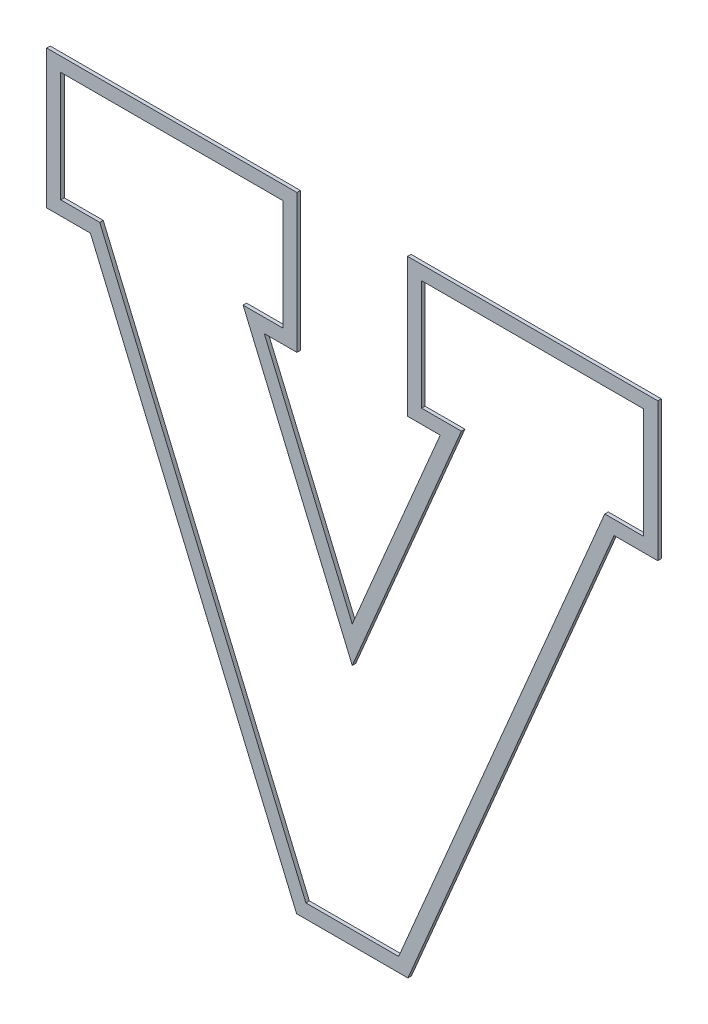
ISO-10303-21;
HEADER;
FILE_DESCRIPTION(('STEP AP214'),'2;1');
FILE_NAME('part.step','',(''),(''),'','','');
FILE_SCHEMA(('AUTOMOTIVE_DESIGN { 1 0 10303 214 1 1 1 1 }'));
ENDSEC;
DATA;
#1=APPLICATION_CONTEXT('core data for automotive mechanical design processes');
#2=APPLICATION_PROTOCOL_DEFINITION('international standard','automotive_design',2000,#1);
#3=PRODUCT_CONTEXT('',#1,'mechanical');
#4=PRODUCT('Part','Part','',(#3));
#5=PRODUCT_RELATED_PRODUCT_CATEGORY('part','',(#4));
#6=PRODUCT_DEFINITION_FORMATION('','',#4);
#7=PRODUCT_DEFINITION_CONTEXT('part definition',#1,'design');
#8=PRODUCT_DEFINITION('design','',#6,#7);
#9=PRODUCT_DEFINITION_SHAPE('','',#8);
#10=(LENGTH_UNIT() NAMED_UNIT(*) SI_UNIT(.MILLI.,.METRE.));
#11=(NAMED_UNIT(*) PLANE_ANGLE_UNIT() SI_UNIT($,.RADIAN.));
#12=(NAMED_UNIT(*) SI_UNIT($,.STERADIAN.) SOLID_ANGLE_UNIT());
#13=UNCERTAINTY_MEASURE_WITH_UNIT(LENGTH_MEASURE(1.E-05),#10,'distance_accuracy_value','');
#14=(GEOMETRIC_REPRESENTATION_CONTEXT(3) GLOBAL_UNCERTAINTY_ASSIGNED_CONTEXT((#13)) GLOBAL_UNIT_ASSIGNED_CONTEXT((#10,
#11,#12)) REPRESENTATION_CONTEXT('',''));
#15=CARTESIAN_POINT('',(0.,0.,0.));
#16=DIRECTION('',(0.,0.,1.));
#17=DIRECTION('',(1.,0.,0.));
#18=AXIS2_PLACEMENT_3D('',#15,#16,#17);
#19=CARTESIAN_POINT('',(0.,0.,3.175));
#20=DIRECTION('',(0.,0.,1.));
#21=DIRECTION('',(1.,0.,0.));
#22=AXIS2_PLACEMENT_3D('',#19,#20,#21);
#23=PLANE('',#22);
#24=DIRECTION('',(0.,-1.,0.));
#25=VECTOR('',#24,1.);
#26=CARTESIAN_POINT('',(326.575403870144,565.454374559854,3.175));
#27=LINE('',#26,#25);
#28=CARTESIAN_POINT('',(326.575403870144,565.454374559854,3.175));
#29=VERTEX_POINT('',#28);
#30=CARTESIAN_POINT('',(326.575403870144,440.106030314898,3.175));
#31=VERTEX_POINT('',#30);
#32=EDGE_CURVE('E344',#29,#31,#27,.T.);
#33=ORIENTED_EDGE('',*,*,#32,.T.);
#34=DIRECTION('',(1.,0.,0.));
#35=VECTOR('',#34,1.);
#36=CARTESIAN_POINT('',(326.575403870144,440.106030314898,3.175));
#37=LINE('',#36,#35);
#38=CARTESIAN_POINT('',(356.125130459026,440.106030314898,3.175));
#39=VERTEX_POINT('',#38);
#40=EDGE_CURVE('E347',#31,#39,#37,.T.);
#41=ORIENTED_EDGE('',*,*,#40,.T.);
#42=DIRECTION('',(-0.39031398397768,-0.920681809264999,0.));
#43=VECTOR('',#42,1.);
#44=CARTESIAN_POINT('',(356.125130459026,440.106030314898,3.175));
#45=LINE('',#44,#43);
#46=CARTESIAN_POINT('',(276.517141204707,252.324832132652,3.175));
#47=VERTEX_POINT('',#46);
#48=EDGE_CURVE('E350',#39,#47,#45,.T.);
#49=ORIENTED_EDGE('',*,*,#48,.T.);
#50=DIRECTION('',(-0.39031398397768,0.920681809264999,0.));
#51=VECTOR('',#50,1.);
#52=CARTESIAN_POINT('',(276.517141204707,252.324832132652,3.175));
#53=LINE('',#52,#51);
#54=CARTESIAN_POINT('',(196.909151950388,440.106030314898,3.175));
#55=VERTEX_POINT('',#54);
#56=EDGE_CURVE('E352',#47,#55,#53,.T.);
#57=ORIENTED_EDGE('',*,*,#56,.T.);
#58=DIRECTION('',(1.,0.,0.));
#59=VECTOR('',#58,1.);
#60=CARTESIAN_POINT('',(196.909151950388,440.106030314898,3.175));
#61=LINE('',#60,#59);
#62=CARTESIAN_POINT('',(226.45887853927,440.106030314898,3.175));
#63=VERTEX_POINT('',#62);
#64=EDGE_CURVE('E354',#55,#63,#61,.T.);
#65=ORIENTED_EDGE('',*,*,#64,.T.);
#66=DIRECTION('',(0.,1.,0.));
#67=VECTOR('',#66,1.);
#68=CARTESIAN_POINT('',(226.45887853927,440.106030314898,3.175));
#69=LINE('',#68,#67);
#70=CARTESIAN_POINT('',(226.45887853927,565.454374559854,3.175));
#71=VERTEX_POINT('',#70);
#72=EDGE_CURVE('E356',#63,#71,#69,.T.);
#73=ORIENTED_EDGE('',*,*,#72,.T.);
#74=DIRECTION('',(-1.,0.,0.));
#75=VECTOR('',#74,1.);
#76=CARTESIAN_POINT('',(226.45887853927,565.454374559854,3.175));
#77=LINE('',#76,#75);
#78=CARTESIAN_POINT('',(0.,565.454374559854,3.175));
#79=VERTEX_POINT('',#78);
#80=EDGE_CURVE('E358',#71,#79,#77,.T.);
#81=ORIENTED_EDGE('',*,*,#80,.T.);
#82=DIRECTION('',(0.,-1.,0.));
#83=VECTOR('',#82,1.);
#84=CARTESIAN_POINT('',(0.,565.454374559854,3.175));
#85=LINE('',#84,#83);
#86=CARTESIAN_POINT('',(0.,440.106030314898,3.175));
#87=VERTEX_POINT('',#86);
#88=EDGE_CURVE('E360',#79,#87,#85,.T.);
#89=ORIENTED_EDGE('',*,*,#88,.T.);
#90=DIRECTION('',(1.,0.,0.));
#91=VECTOR('',#90,1.);
#92=CARTESIAN_POINT('',(0.,440.106030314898,3.175));
#93=LINE('',#92,#91);
#94=CARTESIAN_POINT('',(39.5591606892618,440.106030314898,3.175));
#95=VERTEX_POINT('',#94);
#96=EDGE_CURVE('E362',#87,#95,#93,.T.);
#97=ORIENTED_EDGE('',*,*,#96,.T.);
#98=DIRECTION('',(0.39031398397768,-0.920681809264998,0.));
#99=VECTOR('',#98,1.);
#100=CARTESIAN_POINT('',(39.5591606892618,440.106030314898,3.175));
#101=LINE('',#100,#99);
#102=CARTESIAN_POINT('',(226.137777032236,0.,3.175));
#103=VERTEX_POINT('',#102);
#104=EDGE_CURVE('E364',#95,#103,#101,.T.);
#105=ORIENTED_EDGE('',*,*,#104,.T.);
#106=DIRECTION('',(1.,0.,0.));
#107=VECTOR('',#106,1.);
#108=CARTESIAN_POINT('',(226.137777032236,0.,3.175));
#109=LINE('',#108,#107);
#110=CARTESIAN_POINT('',(326.896505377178,0.,3.175));
#111=VERTEX_POINT('',#110);
#112=EDGE_CURVE('E366',#103,#111,#109,.T.);
#113=ORIENTED_EDGE('',*,*,#112,.T.);
#114=DIRECTION('',(0.39031398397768,0.920681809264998,0.));
#115=VECTOR('',#114,1.);
#116=CARTESIAN_POINT('',(326.896505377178,0.,3.175));
#117=LINE('',#116,#115);
#118=CARTESIAN_POINT('',(513.475121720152,440.106030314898,3.175));
#119=VERTEX_POINT('',#118);
#120=EDGE_CURVE('E368',#111,#119,#117,.T.);
#121=ORIENTED_EDGE('',*,*,#120,.T.);
#122=DIRECTION('',(1.,0.,0.));
#123=VECTOR('',#122,1.);
#124=CARTESIAN_POINT('',(513.475121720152,440.106030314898,3.175));
#125=LINE('',#124,#123);
#126=CARTESIAN_POINT('',(553.034282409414,440.106030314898,3.175));
#127=VERTEX_POINT('',#126);
#128=EDGE_CURVE('E370',#119,#127,#125,.T.);
#129=ORIENTED_EDGE('',*,*,#128,.T.);
#130=DIRECTION('',(0.,1.,0.));
#131=VECTOR('',#130,1.);
#132=CARTESIAN_POINT('',(553.034282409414,440.106030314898,3.175));
#133=LINE('',#132,#131);
#134=CARTESIAN_POINT('',(553.034282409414,565.454374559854,3.175));
#135=VERTEX_POINT('',#134);
#136=EDGE_CURVE('E372',#127,#135,#133,.T.);
#137=ORIENTED_EDGE('',*,*,#136,.T.);
#138=DIRECTION('',(-1.,0.,0.));
#139=VECTOR('',#138,1.);
#140=CARTESIAN_POINT('',(553.034282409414,565.454374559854,3.175));
#141=LINE('',#140,#139);
#142=EDGE_CURVE('E374',#135,#29,#141,.T.);
#143=ORIENTED_EDGE('',*,*,#142,.T.);
#144=EDGE_LOOP('',(#33,#41,#49,#57,#65,#73,#81,#89,#97,#105,#113,#121,#129,#137,#143));
#145=FACE_BOUND('',#144,.T.);
#146=DIRECTION('',(1.,0.,0.));
#147=VECTOR('',#146,1.);
#148=CARTESIAN_POINT('',(540.334282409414,452.806030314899,3.175));
#149=LINE('',#148,#147);
#150=CARTESIAN_POINT('',(505.065036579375,452.806030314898,3.175));
#151=VERTEX_POINT('',#150);
#152=CARTESIAN_POINT('',(540.334282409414,452.806030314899,3.175));
#153=VERTEX_POINT('',#152);
#154=EDGE_CURVE('E238',#151,#153,#149,.T.);
#155=ORIENTED_EDGE('',*,*,#154,.F.);
#156=DIRECTION('',(0.39031398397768,0.920681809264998,0.));
#157=VECTOR('',#156,1.);
#158=CARTESIAN_POINT('',(505.065036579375,452.806030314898,3.175));
#159=LINE('',#158,#157);
#160=CARTESIAN_POINT('',(318.4864202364,12.6999999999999,3.175));
#161=VERTEX_POINT('',#160);
#162=EDGE_CURVE('E230',#161,#151,#159,.T.);
#163=ORIENTED_EDGE('',*,*,#162,.F.);
#164=DIRECTION('',(1.,0.,0.));
#165=VECTOR('',#164,1.);
#166=CARTESIAN_POINT('',(318.4864202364,12.6999999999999,3.175));
#167=LINE('',#166,#165);
#168=CARTESIAN_POINT('',(234.547862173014,12.7,3.175));
#169=VERTEX_POINT('',#168);
#170=EDGE_CURVE('E277',#169,#161,#167,.T.);
#171=ORIENTED_EDGE('',*,*,#170,.F.);
#172=DIRECTION('',(0.39031398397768,-0.920681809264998,0.));
#173=VECTOR('',#172,1.);
#174=CARTESIAN_POINT('',(234.547862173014,12.7,3.175));
#175=LINE('',#174,#173);
#176=CARTESIAN_POINT('',(47.969245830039,452.806030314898,3.175));
#177=VERTEX_POINT('',#176);
#178=EDGE_CURVE('E275',#177,#169,#175,.T.);
#179=ORIENTED_EDGE('',*,*,#178,.F.);
#180=DIRECTION('',(1.,0.,0.));
#181=VECTOR('',#180,1.);
#182=CARTESIAN_POINT('',(47.969245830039,452.806030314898,3.175));
#183=LINE('',#182,#181);
#184=CARTESIAN_POINT('',(12.7,452.806030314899,3.175));
#185=VERTEX_POINT('',#184);
#186=EDGE_CURVE('E273',#185,#177,#183,.T.);
#187=ORIENTED_EDGE('',*,*,#186,.F.);
#188=DIRECTION('',(0.,-1.,0.));
#189=VECTOR('',#188,1.);
#190=CARTESIAN_POINT('',(12.7,452.806030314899,3.175));
#191=LINE('',#190,#189);
#192=CARTESIAN_POINT('',(12.7,552.754374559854,3.175));
#193=VERTEX_POINT('',#192);
#194=EDGE_CURVE('E271',#193,#185,#191,.T.);
#195=ORIENTED_EDGE('',*,*,#194,.F.);
#196=DIRECTION('',(-1.,0.,0.));
#197=VECTOR('',#196,1.);
#198=CARTESIAN_POINT('',(12.7,552.754374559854,3.175));
#199=LINE('',#198,#197);
#200=CARTESIAN_POINT('',(213.75887853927,552.754374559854,3.175));
#201=VERTEX_POINT('',#200);
#202=EDGE_CURVE('E269',#201,#193,#199,.T.);
#203=ORIENTED_EDGE('',*,*,#202,.F.);
#204=DIRECTION('',(0.,1.,0.));
#205=VECTOR('',#204,1.);
#206=CARTESIAN_POINT('',(213.75887853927,552.754374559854,3.175));
#207=LINE('',#206,#205);
#208=CARTESIAN_POINT('',(213.75887853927,452.806030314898,3.175));
#209=VERTEX_POINT('',#208);
#210=EDGE_CURVE('E267',#209,#201,#207,.T.);
#211=ORIENTED_EDGE('',*,*,#210,.F.);
#212=DIRECTION('',(1.,0.,0.));
#213=VECTOR('',#212,1.);
#214=CARTESIAN_POINT('',(213.75887853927,452.806030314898,3.175));
#215=LINE('',#214,#213);
#216=CARTESIAN_POINT('',(177.730987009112,452.806030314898,3.175));
#217=VERTEX_POINT('',#216);
#218=EDGE_CURVE('E265',#217,#209,#215,.T.);
#219=ORIENTED_EDGE('',*,*,#218,.F.);
#220=DIRECTION('',(-0.39031398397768,0.920681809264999,0.));
#221=VECTOR('',#220,1.);
#222=CARTESIAN_POINT('',(177.730987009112,452.806030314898,3.175));
#223=LINE('',#222,#221);
#224=CARTESIAN_POINT('',(276.517141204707,219.78692541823,3.175));
#225=VERTEX_POINT('',#224);
#226=EDGE_CURVE('E263',#225,#217,#223,.T.);
#227=ORIENTED_EDGE('',*,*,#226,.F.);
#228=DIRECTION('',(-0.39031398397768,-0.920681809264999,0.));
#229=VECTOR('',#228,1.);
#230=CARTESIAN_POINT('',(276.517141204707,219.78692541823,3.175));
#231=LINE('',#230,#229);
#232=CARTESIAN_POINT('',(375.303295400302,452.806030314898,3.175));
#233=VERTEX_POINT('',#232);
#234=EDGE_CURVE('E261',#233,#225,#231,.T.);
#235=ORIENTED_EDGE('',*,*,#234,.F.);
#236=DIRECTION('',(1.,0.,0.));
#237=VECTOR('',#236,1.);
#238=CARTESIAN_POINT('',(375.303295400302,452.806030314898,3.175));
#239=LINE('',#238,#237);
#240=CARTESIAN_POINT('',(339.275403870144,452.806030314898,3.175));
#241=VERTEX_POINT('',#240);
#242=EDGE_CURVE('E259',#241,#233,#239,.T.);
#243=ORIENTED_EDGE('',*,*,#242,.F.);
#244=DIRECTION('',(0.,-1.,0.));
#245=VECTOR('',#244,1.);
#246=CARTESIAN_POINT('',(339.275403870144,452.806030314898,3.175));
#247=LINE('',#246,#245);
#248=CARTESIAN_POINT('',(339.275403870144,552.754374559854,3.175));
#249=VERTEX_POINT('',#248);
#250=EDGE_CURVE('E257',#249,#241,#247,.T.);
#251=ORIENTED_EDGE('',*,*,#250,.F.);
#252=DIRECTION('',(-1.,0.,0.));
#253=VECTOR('',#252,1.);
#254=CARTESIAN_POINT('',(339.275403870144,552.754374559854,3.175));
#255=LINE('',#254,#253);
#256=CARTESIAN_POINT('',(540.334282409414,552.754374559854,3.175));
#257=VERTEX_POINT('',#256);
#258=EDGE_CURVE('E253',#257,#249,#255,.T.);
#259=ORIENTED_EDGE('',*,*,#258,.F.);
#260=DIRECTION('',(0.,1.,0.));
#261=VECTOR('',#260,1.);
#262=CARTESIAN_POINT('',(540.334282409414,552.754374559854,3.175));
#263=LINE('',#262,#261);
#264=EDGE_CURVE('E251',#153,#257,#263,.T.);
#265=ORIENTED_EDGE('',*,*,#264,.F.);
#266=EDGE_LOOP('',(#155,#163,#171,#179,#187,#195,#203,#211,#219,#227,#235,#243,#251,#259,#265));
#267=FACE_BOUND('',#266,.T.);
#268=ADVANCED_FACE('F33',(#145,#267),#23,.T.);
#269=CARTESIAN_POINT('',(0.,0.,0.));
#270=DIRECTION('',(0.,0.,1.));
#271=DIRECTION('',(1.,0.,0.));
#272=AXIS2_PLACEMENT_3D('',#269,#270,#271);
#273=PLANE('',#272);
#274=DIRECTION('',(0.,-1.,0.));
#275=VECTOR('',#274,1.);
#276=CARTESIAN_POINT('',(326.575403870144,565.454374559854,0.));
#277=LINE('',#276,#275);
#278=CARTESIAN_POINT('',(326.575403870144,565.454374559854,0.));
#279=VERTEX_POINT('',#278);
#280=CARTESIAN_POINT('',(326.575403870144,440.106030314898,0.));
#281=VERTEX_POINT('',#280);
#282=EDGE_CURVE('E246',#279,#281,#277,.T.);
#283=ORIENTED_EDGE('',*,*,#282,.F.);
#284=DIRECTION('',(-1.,0.,0.));
#285=VECTOR('',#284,1.);
#286=CARTESIAN_POINT('',(553.034282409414,565.454374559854,0.));
#287=LINE('',#286,#285);
#288=CARTESIAN_POINT('',(553.034282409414,565.454374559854,0.));
#289=VERTEX_POINT('',#288);
#290=EDGE_CURVE('E348',#289,#279,#287,.T.);
#291=ORIENTED_EDGE('',*,*,#290,.F.);
#292=DIRECTION('',(0.,1.,0.));
#293=VECTOR('',#292,1.);
#294=CARTESIAN_POINT('',(553.034282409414,440.106030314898,0.));
#295=LINE('',#294,#293);
#296=CARTESIAN_POINT('',(553.034282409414,440.106030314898,0.));
#297=VERTEX_POINT('',#296);
#298=EDGE_CURVE('E403',#297,#289,#295,.T.);
#299=ORIENTED_EDGE('',*,*,#298,.F.);
#300=DIRECTION('',(1.,0.,0.));
#301=VECTOR('',#300,1.);
#302=CARTESIAN_POINT('',(513.475121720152,440.106030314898,0.));
#303=LINE('',#302,#301);
#304=CARTESIAN_POINT('',(513.475121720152,440.106030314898,0.));
#305=VERTEX_POINT('',#304);
#306=EDGE_CURVE('E401',#305,#297,#303,.T.);
#307=ORIENTED_EDGE('',*,*,#306,.F.);
#308=DIRECTION('',(0.39031398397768,0.920681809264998,0.));
#309=VECTOR('',#308,1.);
#310=CARTESIAN_POINT('',(326.896505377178,0.,0.));
#311=LINE('',#310,#309);
#312=CARTESIAN_POINT('',(326.896505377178,0.,0.));
#313=VERTEX_POINT('',#312);
#314=EDGE_CURVE('E399',#313,#305,#311,.T.);
#315=ORIENTED_EDGE('',*,*,#314,.F.);
#316=DIRECTION('',(1.,0.,0.));
#317=VECTOR('',#316,1.);
#318=CARTESIAN_POINT('',(226.137777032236,0.,0.));
#319=LINE('',#318,#317);
#320=CARTESIAN_POINT('',(226.137777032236,0.,0.));
#321=VERTEX_POINT('',#320);
#322=EDGE_CURVE('E397',#321,#313,#319,.T.);
#323=ORIENTED_EDGE('',*,*,#322,.F.);
#324=DIRECTION('',(0.39031398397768,-0.920681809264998,0.));
#325=VECTOR('',#324,1.);
#326=CARTESIAN_POINT('',(39.5591606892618,440.106030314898,0.));
#327=LINE('',#326,#325);
#328=CARTESIAN_POINT('',(39.5591606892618,440.106030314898,0.));
#329=VERTEX_POINT('',#328);
#330=EDGE_CURVE('E395',#329,#321,#327,.T.);
#331=ORIENTED_EDGE('',*,*,#330,.F.);
#332=DIRECTION('',(1.,0.,0.));
#333=VECTOR('',#332,1.);
#334=CARTESIAN_POINT('',(0.,440.106030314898,0.));
#335=LINE('',#334,#333);
#336=CARTESIAN_POINT('',(0.,440.106030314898,0.));
#337=VERTEX_POINT('',#336);
#338=EDGE_CURVE('E393',#337,#329,#335,.T.);
#339=ORIENTED_EDGE('',*,*,#338,.F.);
#340=DIRECTION('',(0.,-1.,0.));
#341=VECTOR('',#340,1.);
#342=CARTESIAN_POINT('',(0.,565.454374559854,0.));
#343=LINE('',#342,#341);
#344=CARTESIAN_POINT('',(0.,565.454374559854,0.));
#345=VERTEX_POINT('',#344);
#346=EDGE_CURVE('E391',#345,#337,#343,.T.);
#347=ORIENTED_EDGE('',*,*,#346,.F.);
#348=DIRECTION('',(-1.,0.,0.));
#349=VECTOR('',#348,1.);
#350=CARTESIAN_POINT('',(226.45887853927,565.454374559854,0.));
#351=LINE('',#350,#349);
#352=CARTESIAN_POINT('',(226.45887853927,565.454374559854,0.));
#353=VERTEX_POINT('',#352);
#354=EDGE_CURVE('E389',#353,#345,#351,.T.);
#355=ORIENTED_EDGE('',*,*,#354,.F.);
#356=DIRECTION('',(0.,1.,0.));
#357=VECTOR('',#356,1.);
#358=CARTESIAN_POINT('',(226.45887853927,440.106030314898,0.));
#359=LINE('',#358,#357);
#360=CARTESIAN_POINT('',(226.45887853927,440.106030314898,0.));
#361=VERTEX_POINT('',#360);
#362=EDGE_CURVE('E387',#361,#353,#359,.T.);
#363=ORIENTED_EDGE('',*,*,#362,.F.);
#364=DIRECTION('',(1.,0.,0.));
#365=VECTOR('',#364,1.);
#366=CARTESIAN_POINT('',(196.909151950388,440.106030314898,0.));
#367=LINE('',#366,#365);
#368=CARTESIAN_POINT('',(196.909151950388,440.106030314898,0.));
#369=VERTEX_POINT('',#368);
#370=EDGE_CURVE('E385',#369,#361,#367,.T.);
#371=ORIENTED_EDGE('',*,*,#370,.F.);
#372=DIRECTION('',(-0.39031398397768,0.920681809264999,0.));
#373=VECTOR('',#372,1.);
#374=CARTESIAN_POINT('',(276.517141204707,252.324832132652,0.));
#375=LINE('',#374,#373);
#376=CARTESIAN_POINT('',(276.517141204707,252.324832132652,0.));
#377=VERTEX_POINT('',#376);
#378=EDGE_CURVE('E383',#377,#369,#375,.T.);
#379=ORIENTED_EDGE('',*,*,#378,.F.);
#380=DIRECTION('',(-0.39031398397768,-0.920681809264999,0.));
#381=VECTOR('',#380,1.);
#382=CARTESIAN_POINT('',(356.125130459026,440.106030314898,0.));
#383=LINE('',#382,#381);
#384=CARTESIAN_POINT('',(356.125130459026,440.106030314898,0.));
#385=VERTEX_POINT('',#384);
#386=EDGE_CURVE('E381',#385,#377,#383,.T.);
#387=ORIENTED_EDGE('',*,*,#386,.F.);
#388=DIRECTION('',(1.,0.,0.));
#389=VECTOR('',#388,1.);
#390=CARTESIAN_POINT('',(326.575403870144,440.106030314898,0.));
#391=LINE('',#390,#389);
#392=EDGE_CURVE('E379',#281,#385,#391,.T.);
#393=ORIENTED_EDGE('',*,*,#392,.F.);
#394=EDGE_LOOP('',(#283,#291,#299,#307,#315,#323,#331,#339,#347,#355,#363,#371,#379,#387,#393));
#395=FACE_BOUND('',#394,.T.);
#396=DIRECTION('',(0.39031398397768,0.920681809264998,0.));
#397=VECTOR('',#396,1.);
#398=CARTESIAN_POINT('',(505.065036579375,452.806030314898,0.));
#399=LINE('',#398,#397);
#400=CARTESIAN_POINT('',(318.4864202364,12.6999999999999,0.));
#401=VERTEX_POINT('',#400);
#402=CARTESIAN_POINT('',(505.065036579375,452.806030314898,0.));
#403=VERTEX_POINT('',#402);
#404=EDGE_CURVE('E56',#401,#403,#399,.T.);
#405=ORIENTED_EDGE('',*,*,#404,.T.);
#406=DIRECTION('',(1.,0.,0.));
#407=VECTOR('',#406,1.);
#408=CARTESIAN_POINT('',(540.334282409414,452.806030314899,0.));
#409=LINE('',#408,#407);
#410=CARTESIAN_POINT('',(540.334282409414,452.806030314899,0.));
#411=VERTEX_POINT('',#410);
#412=EDGE_CURVE('E245',#403,#411,#409,.T.);
#413=ORIENTED_EDGE('',*,*,#412,.T.);
#414=DIRECTION('',(0.,1.,0.));
#415=VECTOR('',#414,1.);
#416=CARTESIAN_POINT('',(540.334282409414,552.754374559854,0.));
#417=LINE('',#416,#415);
#418=CARTESIAN_POINT('',(540.334282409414,552.754374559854,0.));
#419=VERTEX_POINT('',#418);
#420=EDGE_CURVE('E281',#411,#419,#417,.T.);
#421=ORIENTED_EDGE('',*,*,#420,.T.);
#422=DIRECTION('',(-1.,0.,0.));
#423=VECTOR('',#422,1.);
#424=CARTESIAN_POINT('',(339.275403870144,552.754374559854,0.));
#425=LINE('',#424,#423);
#426=CARTESIAN_POINT('',(339.275403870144,552.754374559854,0.));
#427=VERTEX_POINT('',#426);
#428=EDGE_CURVE('E284',#419,#427,#425,.T.);
#429=ORIENTED_EDGE('',*,*,#428,.T.);
#430=DIRECTION('',(0.,-1.,0.));
#431=VECTOR('',#430,1.);
#432=CARTESIAN_POINT('',(339.275403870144,452.806030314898,0.));
#433=LINE('',#432,#431);
#434=CARTESIAN_POINT('',(339.275403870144,452.806030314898,0.));
#435=VERTEX_POINT('',#434);
#436=EDGE_CURVE('E287',#427,#435,#433,.T.);
#437=ORIENTED_EDGE('',*,*,#436,.T.);
#438=DIRECTION('',(1.,0.,0.));
#439=VECTOR('',#438,1.);
#440=CARTESIAN_POINT('',(375.303295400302,452.806030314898,0.));
#441=LINE('',#440,#439);
#442=CARTESIAN_POINT('',(375.303295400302,452.806030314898,0.));
#443=VERTEX_POINT('',#442);
#444=EDGE_CURVE('E290',#435,#443,#441,.T.);
#445=ORIENTED_EDGE('',*,*,#444,.T.);
#446=DIRECTION('',(-0.39031398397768,-0.920681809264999,0.));
#447=VECTOR('',#446,1.);
#448=CARTESIAN_POINT('',(276.517141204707,219.78692541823,0.));
#449=LINE('',#448,#447);
#450=CARTESIAN_POINT('',(276.517141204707,219.78692541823,0.));
#451=VERTEX_POINT('',#450);
#452=EDGE_CURVE('E293',#443,#451,#449,.T.);
#453=ORIENTED_EDGE('',*,*,#452,.T.);
#454=DIRECTION('',(-0.39031398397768,0.920681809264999,0.));
#455=VECTOR('',#454,1.);
#456=CARTESIAN_POINT('',(177.730987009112,452.806030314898,0.));
#457=LINE('',#456,#455);
#458=CARTESIAN_POINT('',(177.730987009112,452.806030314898,0.));
#459=VERTEX_POINT('',#458);
#460=EDGE_CURVE('E296',#451,#459,#457,.T.);
#461=ORIENTED_EDGE('',*,*,#460,.T.);
#462=DIRECTION('',(1.,0.,0.));
#463=VECTOR('',#462,1.);
#464=CARTESIAN_POINT('',(213.75887853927,452.806030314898,0.));
#465=LINE('',#464,#463);
#466=CARTESIAN_POINT('',(213.75887853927,452.806030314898,0.));
#467=VERTEX_POINT('',#466);
#468=EDGE_CURVE('E299',#459,#467,#465,.T.);
#469=ORIENTED_EDGE('',*,*,#468,.T.);
#470=DIRECTION('',(0.,1.,0.));
#471=VECTOR('',#470,1.);
#472=CARTESIAN_POINT('',(213.75887853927,552.754374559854,0.));
#473=LINE('',#472,#471);
#474=CARTESIAN_POINT('',(213.75887853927,552.754374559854,0.));
#475=VERTEX_POINT('',#474);
#476=EDGE_CURVE('E302',#467,#475,#473,.T.);
#477=ORIENTED_EDGE('',*,*,#476,.T.);
#478=DIRECTION('',(-1.,0.,0.));
#479=VECTOR('',#478,1.);
#480=CARTESIAN_POINT('',(12.7,552.754374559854,0.));
#481=LINE('',#480,#479);
#482=CARTESIAN_POINT('',(12.7,552.754374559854,0.));
#483=VERTEX_POINT('',#482);
#484=EDGE_CURVE('E305',#475,#483,#481,.T.);
#485=ORIENTED_EDGE('',*,*,#484,.T.);
#486=DIRECTION('',(0.,-1.,0.));
#487=VECTOR('',#486,1.);
#488=CARTESIAN_POINT('',(12.7,452.806030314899,0.));
#489=LINE('',#488,#487);
#490=CARTESIAN_POINT('',(12.7,452.806030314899,0.));
#491=VERTEX_POINT('',#490);
#492=EDGE_CURVE('E308',#483,#491,#489,.T.);
#493=ORIENTED_EDGE('',*,*,#492,.T.);
#494=DIRECTION('',(1.,0.,0.));
#495=VECTOR('',#494,1.);
#496=CARTESIAN_POINT('',(47.969245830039,452.806030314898,0.));
#497=LINE('',#496,#495);
#498=CARTESIAN_POINT('',(47.969245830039,452.806030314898,0.));
#499=VERTEX_POINT('',#498);
#500=EDGE_CURVE('E311',#491,#499,#497,.T.);
#501=ORIENTED_EDGE('',*,*,#500,.T.);
#502=DIRECTION('',(0.39031398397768,-0.920681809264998,0.));
#503=VECTOR('',#502,1.);
#504=CARTESIAN_POINT('',(234.547862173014,12.7,0.));
#505=LINE('',#504,#503);
#506=CARTESIAN_POINT('',(234.547862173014,12.7,0.));
#507=VERTEX_POINT('',#506);
#508=EDGE_CURVE('E314',#499,#507,#505,.T.);
#509=ORIENTED_EDGE('',*,*,#508,.T.);
#510=DIRECTION('',(1.,0.,0.));
#511=VECTOR('',#510,1.);
#512=CARTESIAN_POINT('',(318.4864202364,12.6999999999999,0.));
#513=LINE('',#512,#511);
#514=EDGE_CURVE('E239',#507,#401,#513,.T.);
#515=ORIENTED_EDGE('',*,*,#514,.T.);
#516=EDGE_LOOP('',(#405,#413,#421,#429,#437,#445,#453,#461,#469,#477,#485,#493,#501,#509,#515));
#517=FACE_BOUND('',#516,.T.);
#518=ADVANCED_FACE('F454',(#395,#517),#273,.F.);
#519=CARTESIAN_POINT('',(326.575403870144,565.454374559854,3.175));
#520=DIRECTION('',(1.,0.,0.));
#521=DIRECTION('',(0.,0.,-1.));
#522=AXIS2_PLACEMENT_3D('',#519,#520,#521);
#523=PLANE('',#522);
#524=ORIENTED_EDGE('',*,*,#282,.T.);
#525=DIRECTION('',(0.,0.,-1.));
#526=VECTOR('',#525,1.);
#527=CARTESIAN_POINT('',(326.575403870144,440.106030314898,3.175));
#528=LINE('',#527,#526);
#529=EDGE_CURVE('E11',#31,#281,#528,.T.);
#530=ORIENTED_EDGE('',*,*,#529,.F.);
#531=ORIENTED_EDGE('',*,*,#32,.F.);
#532=DIRECTION('',(0.,0.,-1.));
#533=VECTOR('',#532,1.);
#534=CARTESIAN_POINT('',(326.575403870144,565.454374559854,3.175));
#535=LINE('',#534,#533);
#536=EDGE_CURVE('E376',#29,#279,#535,.T.);
#537=ORIENTED_EDGE('',*,*,#536,.T.);
#538=EDGE_LOOP('',(#524,#530,#531,#537));
#539=FACE_BOUND('',#538,.T.);
#540=ADVANCED_FACE('F35',(#539),#523,.F.);
#541=CARTESIAN_POINT('',(326.575403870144,440.106030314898,3.175));
#542=DIRECTION('',(0.,1.,0.));
#543=DIRECTION('',(0.,0.,1.));
#544=AXIS2_PLACEMENT_3D('',#541,#542,#543);
#545=PLANE('',#544);
#546=ORIENTED_EDGE('',*,*,#392,.T.);
#547=DIRECTION('',(0.,0.,-1.));
#548=VECTOR('',#547,1.);
#549=CARTESIAN_POINT('',(356.125130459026,440.106030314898,3.175));
#550=LINE('',#549,#548);
#551=EDGE_CURVE('E41',#39,#385,#550,.T.);
#552=ORIENTED_EDGE('',*,*,#551,.F.);
#553=ORIENTED_EDGE('',*,*,#40,.F.);
#554=ORIENTED_EDGE('',*,*,#529,.T.);
#555=EDGE_LOOP('',(#546,#552,#553,#554));
#556=FACE_BOUND('',#555,.T.);
#557=ADVANCED_FACE('F471',(#556),#545,.F.);
#558=CARTESIAN_POINT('',(356.125130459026,440.106030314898,3.175));
#559=DIRECTION('',(0.920681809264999,-0.39031398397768,0.));
#560=DIRECTION('',(0.39031398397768,0.920681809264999,0.));
#561=AXIS2_PLACEMENT_3D('',#558,#559,#560);
#562=PLANE('',#561);
#563=ORIENTED_EDGE('',*,*,#386,.T.);
#564=DIRECTION('',(0.,0.,-1.));
#565=VECTOR('',#564,1.);
#566=CARTESIAN_POINT('',(276.517141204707,252.324832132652,3.175));
#567=LINE('',#566,#565);
#568=EDGE_CURVE('E441',#47,#377,#567,.T.);
#569=ORIENTED_EDGE('',*,*,#568,.F.);
#570=ORIENTED_EDGE('',*,*,#48,.F.);
#571=ORIENTED_EDGE('',*,*,#551,.T.);
#572=EDGE_LOOP('',(#563,#569,#570,#571));
#573=FACE_BOUND('',#572,.T.);
#574=ADVANCED_FACE('F448',(#573),#562,.F.);
#575=CARTESIAN_POINT('',(276.517141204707,252.324832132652,3.175));
#576=DIRECTION('',(-0.920681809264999,-0.39031398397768,0.));
#577=DIRECTION('',(0.39031398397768,-0.920681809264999,0.));
#578=AXIS2_PLACEMENT_3D('',#575,#576,#577);
#579=PLANE('',#578);
#580=ORIENTED_EDGE('',*,*,#378,.T.);
#581=DIRECTION('',(0.,0.,-1.));
#582=VECTOR('',#581,1.);
#583=CARTESIAN_POINT('',(196.909151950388,440.106030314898,3.175));
#584=LINE('',#583,#582);
#585=EDGE_CURVE('E438',#55,#369,#584,.T.);
#586=ORIENTED_EDGE('',*,*,#585,.F.);
#587=ORIENTED_EDGE('',*,*,#56,.F.);
#588=ORIENTED_EDGE('',*,*,#568,.T.);
#589=EDGE_LOOP('',(#580,#586,#587,#588));
#590=FACE_BOUND('',#589,.T.);
#591=ADVANCED_FACE('F460',(#590),#579,.F.);
#592=CARTESIAN_POINT('',(196.909151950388,440.106030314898,3.175));
#593=DIRECTION('',(0.,1.,0.));
#594=DIRECTION('',(0.,0.,1.));
#595=AXIS2_PLACEMENT_3D('',#592,#593,#594);
#596=PLANE('',#595);
#597=ORIENTED_EDGE('',*,*,#370,.T.);
#598=DIRECTION('',(0.,0.,-1.));
#599=VECTOR('',#598,1.);
#600=CARTESIAN_POINT('',(226.45887853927,440.106030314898,3.175));
#601=LINE('',#600,#599);
#602=EDGE_CURVE('E435',#63,#361,#601,.T.);
#603=ORIENTED_EDGE('',*,*,#602,.F.);
#604=ORIENTED_EDGE('',*,*,#64,.F.);
#605=ORIENTED_EDGE('',*,*,#585,.T.);
#606=EDGE_LOOP('',(#597,#603,#604,#605));
#607=FACE_BOUND('',#606,.T.);
#608=ADVANCED_FACE('F464',(#607),#596,.F.);
#609=CARTESIAN_POINT('',(226.45887853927,440.106030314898,3.175));
#610=DIRECTION('',(-1.,0.,0.));
#611=DIRECTION('',(0.,-1.,0.));
#612=AXIS2_PLACEMENT_3D('',#609,#610,#611);
#613=PLANE('',#612);
#614=ORIENTED_EDGE('',*,*,#362,.T.);
#615=DIRECTION('',(0.,0.,-1.));
#616=VECTOR('',#615,1.);
#617=CARTESIAN_POINT('',(226.45887853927,565.454374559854,3.175));
#618=LINE('',#617,#616);
#619=EDGE_CURVE('E432',#71,#353,#618,.T.);
#620=ORIENTED_EDGE('',*,*,#619,.F.);
#621=ORIENTED_EDGE('',*,*,#72,.F.);
#622=ORIENTED_EDGE('',*,*,#602,.T.);
#623=EDGE_LOOP('',(#614,#620,#621,#622));
#624=FACE_BOUND('',#623,.T.);
#625=ADVANCED_FACE('F519',(#624),#613,.F.);
#626=CARTESIAN_POINT('',(226.45887853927,565.454374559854,3.175));
#627=DIRECTION('',(0.,-1.,0.));
#628=DIRECTION('',(0.,0.,-1.));
#629=AXIS2_PLACEMENT_3D('',#626,#627,#628);
#630=PLANE('',#629);
#631=ORIENTED_EDGE('',*,*,#354,.T.);
#632=DIRECTION('',(0.,0.,-1.));
#633=VECTOR('',#632,1.);
#634=CARTESIAN_POINT('',(0.,565.454374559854,3.175));
#635=LINE('',#634,#633);
#636=EDGE_CURVE('E429',#79,#345,#635,.T.);
#637=ORIENTED_EDGE('',*,*,#636,.F.);
#638=ORIENTED_EDGE('',*,*,#80,.F.);
#639=ORIENTED_EDGE('',*,*,#619,.T.);
#640=EDGE_LOOP('',(#631,#637,#638,#639));
#641=FACE_BOUND('',#640,.T.);
#642=ADVANCED_FACE('F517',(#641),#630,.F.);
#643=CARTESIAN_POINT('',(0.,565.454374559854,3.175));
#644=DIRECTION('',(1.,0.,0.));
#645=DIRECTION('',(0.,0.,-1.));
#646=AXIS2_PLACEMENT_3D('',#643,#644,#645);
#647=PLANE('',#646);
#648=ORIENTED_EDGE('',*,*,#346,.T.);
#649=DIRECTION('',(0.,0.,-1.));
#650=VECTOR('',#649,1.);
#651=CARTESIAN_POINT('',(0.,440.106030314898,3.175));
#652=LINE('',#651,#650);
#653=EDGE_CURVE('E426',#87,#337,#652,.T.);
#654=ORIENTED_EDGE('',*,*,#653,.F.);
#655=ORIENTED_EDGE('',*,*,#88,.F.);
#656=ORIENTED_EDGE('',*,*,#636,.T.);
#657=EDGE_LOOP('',(#648,#654,#655,#656));
#658=FACE_BOUND('',#657,.T.);
#659=ADVANCED_FACE('F513',(#658),#647,.F.);
#660=CARTESIAN_POINT('',(0.,440.106030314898,3.175));
#661=DIRECTION('',(0.,1.,0.));
#662=DIRECTION('',(0.,0.,1.));
#663=AXIS2_PLACEMENT_3D('',#660,#661,#662);
#664=PLANE('',#663);
#665=ORIENTED_EDGE('',*,*,#338,.T.);
#666=DIRECTION('',(0.,0.,-1.));
#667=VECTOR('',#666,1.);
#668=CARTESIAN_POINT('',(39.5591606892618,440.106030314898,3.175));
#669=LINE('',#668,#667);
#670=EDGE_CURVE('E423',#95,#329,#669,.T.);
#671=ORIENTED_EDGE('',*,*,#670,.F.);
#672=ORIENTED_EDGE('',*,*,#96,.F.);
#673=ORIENTED_EDGE('',*,*,#653,.T.);
#674=EDGE_LOOP('',(#665,#671,#672,#673));
#675=FACE_BOUND('',#674,.T.);
#676=ADVANCED_FACE('F508',(#675),#664,.F.);
#677=CARTESIAN_POINT('',(39.5591606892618,440.106030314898,3.175));
#678=DIRECTION('',(0.920681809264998,0.39031398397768,0.));
#679=DIRECTION('',(-0.390313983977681,0.920681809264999,0.));
#680=AXIS2_PLACEMENT_3D('',#677,#678,#679);
#681=PLANE('',#680);
#682=ORIENTED_EDGE('',*,*,#330,.T.);
#683=DIRECTION('',(0.,0.,-1.));
#684=VECTOR('',#683,1.);
#685=CARTESIAN_POINT('',(226.137777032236,0.,3.175));
#686=LINE('',#685,#684);
#687=EDGE_CURVE('E420',#103,#321,#686,.T.);
#688=ORIENTED_EDGE('',*,*,#687,.F.);
#689=ORIENTED_EDGE('',*,*,#104,.F.);
#690=ORIENTED_EDGE('',*,*,#670,.T.);
#691=EDGE_LOOP('',(#682,#688,#689,#690));
#692=FACE_BOUND('',#691,.T.);
#693=ADVANCED_FACE('F502',(#692),#681,.F.);
#694=CARTESIAN_POINT('',(226.137777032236,0.,3.175));
#695=DIRECTION('',(0.,1.,0.));
#696=DIRECTION('',(-1.,0.,0.));
#697=AXIS2_PLACEMENT_3D('',#694,#695,#696);
#698=PLANE('',#697);
#699=ORIENTED_EDGE('',*,*,#322,.T.);
#700=DIRECTION('',(0.,0.,-1.));
#701=VECTOR('',#700,1.);
#702=CARTESIAN_POINT('',(326.896505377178,0.,3.175));
#703=LINE('',#702,#701);
#704=EDGE_CURVE('E417',#111,#313,#703,.T.);
#705=ORIENTED_EDGE('',*,*,#704,.F.);
#706=ORIENTED_EDGE('',*,*,#112,.F.);
#707=ORIENTED_EDGE('',*,*,#687,.T.);
#708=EDGE_LOOP('',(#699,#705,#706,#707));
#709=FACE_BOUND('',#708,.T.);
#710=ADVANCED_FACE('F498',(#709),#698,.F.);
#711=CARTESIAN_POINT('',(326.896505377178,0.,3.175));
#712=DIRECTION('',(-0.920681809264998,0.39031398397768,0.));
#713=DIRECTION('',(-0.39031398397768,-0.920681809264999,0.));
#714=AXIS2_PLACEMENT_3D('',#711,#712,#713);
#715=PLANE('',#714);
#716=ORIENTED_EDGE('',*,*,#314,.T.);
#717=DIRECTION('',(0.,0.,-1.));
#718=VECTOR('',#717,1.);
#719=CARTESIAN_POINT('',(513.475121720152,440.106030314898,3.175));
#720=LINE('',#719,#718);
#721=EDGE_CURVE('E414',#119,#305,#720,.T.);
#722=ORIENTED_EDGE('',*,*,#721,.F.);
#723=ORIENTED_EDGE('',*,*,#120,.F.);
#724=ORIENTED_EDGE('',*,*,#704,.T.);
#725=EDGE_LOOP('',(#716,#722,#723,#724));
#726=FACE_BOUND('',#725,.T.);
#727=ADVANCED_FACE('F493',(#726),#715,.F.);
#728=CARTESIAN_POINT('',(513.475121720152,440.106030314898,3.175));
#729=DIRECTION('',(0.,1.,0.));
#730=DIRECTION('',(0.,0.,1.));
#731=AXIS2_PLACEMENT_3D('',#728,#729,#730);
#732=PLANE('',#731);
#733=ORIENTED_EDGE('',*,*,#306,.T.);
#734=DIRECTION('',(0.,0.,-1.));
#735=VECTOR('',#734,1.);
#736=CARTESIAN_POINT('',(553.034282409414,440.106030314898,3.175));
#737=LINE('',#736,#735);
#738=EDGE_CURVE('E411',#127,#297,#737,.T.);
#739=ORIENTED_EDGE('',*,*,#738,.F.);
#740=ORIENTED_EDGE('',*,*,#128,.F.);
#741=ORIENTED_EDGE('',*,*,#721,.T.);
#742=EDGE_LOOP('',(#733,#739,#740,#741));
#743=FACE_BOUND('',#742,.T.);
#744=ADVANCED_FACE('F487',(#743),#732,.F.);
#745=CARTESIAN_POINT('',(553.034282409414,440.106030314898,3.175));
#746=DIRECTION('',(-1.,0.,0.));
#747=DIRECTION('',(0.,0.,1.));
#748=AXIS2_PLACEMENT_3D('',#745,#746,#747);
#749=PLANE('',#748);
#750=ORIENTED_EDGE('',*,*,#298,.T.);
#751=DIRECTION('',(0.,0.,-1.));
#752=VECTOR('',#751,1.);
#753=CARTESIAN_POINT('',(553.034282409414,565.454374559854,3.175));
#754=LINE('',#753,#752);
#755=EDGE_CURVE('E408',#135,#289,#754,.T.);
#756=ORIENTED_EDGE('',*,*,#755,.F.);
#757=ORIENTED_EDGE('',*,*,#136,.F.);
#758=ORIENTED_EDGE('',*,*,#738,.T.);
#759=EDGE_LOOP('',(#750,#756,#757,#758));
#760=FACE_BOUND('',#759,.T.);
#761=ADVANCED_FACE('F483',(#760),#749,.F.);
#762=CARTESIAN_POINT('',(553.034282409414,565.454374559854,3.175));
#763=DIRECTION('',(0.,-1.,0.));
#764=DIRECTION('',(0.,0.,-1.));
#765=AXIS2_PLACEMENT_3D('',#762,#763,#764);
#766=PLANE('',#765);
#767=ORIENTED_EDGE('',*,*,#290,.T.);
#768=ORIENTED_EDGE('',*,*,#536,.F.);
#769=ORIENTED_EDGE('',*,*,#142,.F.);
#770=ORIENTED_EDGE('',*,*,#755,.T.);
#771=EDGE_LOOP('',(#767,#768,#769,#770));
#772=FACE_BOUND('',#771,.T.);
#773=ADVANCED_FACE('F478',(#772),#766,.F.);
#774=CARTESIAN_POINT('',(505.065036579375,452.806030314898,3.175));
#775=DIRECTION('',(-0.920681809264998,0.39031398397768,0.));
#776=DIRECTION('',(-0.390313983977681,-0.920681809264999,0.));
#777=AXIS2_PLACEMENT_3D('',#774,#775,#776);
#778=PLANE('',#777);
#779=ORIENTED_EDGE('',*,*,#404,.F.);
#780=DIRECTION('',(0.,0.,-1.));
#781=VECTOR('',#780,1.);
#782=CARTESIAN_POINT('',(318.4864202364,12.6999999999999,3.175));
#783=LINE('',#782,#781);
#784=EDGE_CURVE('E234',#161,#401,#783,.T.);
#785=ORIENTED_EDGE('',*,*,#784,.F.);
#786=ORIENTED_EDGE('',*,*,#162,.T.);
#787=DIRECTION('',(0.,0.,-1.));
#788=VECTOR('',#787,1.);
#789=CARTESIAN_POINT('',(505.065036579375,452.806030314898,3.175));
#790=LINE('',#789,#788);
#791=EDGE_CURVE('E233',#151,#403,#790,.T.);
#792=ORIENTED_EDGE('',*,*,#791,.T.);
#793=EDGE_LOOP('',(#779,#785,#786,#792));
#794=FACE_BOUND('',#793,.T.);
#795=ADVANCED_FACE('F232',(#794),#778,.T.);
#796=CARTESIAN_POINT('',(540.334282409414,452.806030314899,3.175));
#797=DIRECTION('',(0.,1.,0.));
#798=DIRECTION('',(-1.,0.,0.));
#799=AXIS2_PLACEMENT_3D('',#796,#797,#798);
#800=PLANE('',#799);
#801=ORIENTED_EDGE('',*,*,#412,.F.);
#802=ORIENTED_EDGE('',*,*,#791,.F.);
#803=ORIENTED_EDGE('',*,*,#154,.T.);
#804=DIRECTION('',(0.,0.,-1.));
#805=VECTOR('',#804,1.);
#806=CARTESIAN_POINT('',(540.334282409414,452.806030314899,3.175));
#807=LINE('',#806,#805);
#808=EDGE_CURVE('E247',#153,#411,#807,.T.);
#809=ORIENTED_EDGE('',*,*,#808,.T.);
#810=EDGE_LOOP('',(#801,#802,#803,#809));
#811=FACE_BOUND('',#810,.T.);
#812=ADVANCED_FACE('F242',(#811),#800,.T.);
#813=CARTESIAN_POINT('',(540.334282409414,552.754374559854,3.175));
#814=DIRECTION('',(-1.,0.,0.));
#815=DIRECTION('',(0.,0.,1.));
#816=AXIS2_PLACEMENT_3D('',#813,#814,#815);
#817=PLANE('',#816);
#818=ORIENTED_EDGE('',*,*,#420,.F.);
#819=ORIENTED_EDGE('',*,*,#808,.F.);
#820=ORIENTED_EDGE('',*,*,#264,.T.);
#821=DIRECTION('',(0.,0.,-1.));
#822=VECTOR('',#821,1.);
#823=CARTESIAN_POINT('',(540.334282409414,552.754374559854,3.175));
#824=LINE('',#823,#822);
#825=EDGE_CURVE('E341',#257,#419,#824,.T.);
#826=ORIENTED_EDGE('',*,*,#825,.T.);
#827=EDGE_LOOP('',(#818,#819,#820,#826));
#828=FACE_BOUND('',#827,.T.);
#829=ADVANCED_FACE('F595',(#828),#817,.T.);
#830=CARTESIAN_POINT('',(339.275403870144,552.754374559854,3.175));
#831=DIRECTION('',(0.,-1.,0.));
#832=DIRECTION('',(0.,0.,-1.));
#833=AXIS2_PLACEMENT_3D('',#830,#831,#832);
#834=PLANE('',#833);
#835=ORIENTED_EDGE('',*,*,#428,.F.);
#836=ORIENTED_EDGE('',*,*,#825,.F.);
#837=ORIENTED_EDGE('',*,*,#258,.T.);
#838=DIRECTION('',(0.,0.,-1.));
#839=VECTOR('',#838,1.);
#840=CARTESIAN_POINT('',(339.275403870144,552.754374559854,3.175));
#841=LINE('',#840,#839);
#842=EDGE_CURVE('E339',#249,#427,#841,.T.);
#843=ORIENTED_EDGE('',*,*,#842,.T.);
#844=EDGE_LOOP('',(#835,#836,#837,#843));
#845=FACE_BOUND('',#844,.T.);
#846=ADVANCED_FACE('F601',(#845),#834,.T.);
#847=CARTESIAN_POINT('',(339.275403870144,452.806030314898,3.175));
#848=DIRECTION('',(1.,0.,0.));
#849=DIRECTION('',(0.,1.,0.));
#850=AXIS2_PLACEMENT_3D('',#847,#848,#849);
#851=PLANE('',#850);
#852=ORIENTED_EDGE('',*,*,#436,.F.);
#853=ORIENTED_EDGE('',*,*,#842,.F.);
#854=ORIENTED_EDGE('',*,*,#250,.T.);
#855=DIRECTION('',(0.,0.,-1.));
#856=VECTOR('',#855,1.);
#857=CARTESIAN_POINT('',(339.275403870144,452.806030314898,3.175));
#858=LINE('',#857,#856);
#859=EDGE_CURVE('E337',#241,#435,#858,.T.);
#860=ORIENTED_EDGE('',*,*,#859,.T.);
#861=EDGE_LOOP('',(#852,#853,#854,#860));
#862=FACE_BOUND('',#861,.T.);
#863=ADVANCED_FACE('F609',(#862),#851,.T.);
#864=CARTESIAN_POINT('',(375.303295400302,452.806030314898,3.175));
#865=DIRECTION('',(0.,1.,0.));
#866=DIRECTION('',(-1.,0.,0.));
#867=AXIS2_PLACEMENT_3D('',#864,#865,#866);
#868=PLANE('',#867);
#869=ORIENTED_EDGE('',*,*,#444,.F.);
#870=ORIENTED_EDGE('',*,*,#859,.F.);
#871=ORIENTED_EDGE('',*,*,#242,.T.);
#872=DIRECTION('',(0.,0.,-1.));
#873=VECTOR('',#872,1.);
#874=CARTESIAN_POINT('',(375.303295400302,452.806030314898,3.175));
#875=LINE('',#874,#873);
#876=EDGE_CURVE('E335',#233,#443,#875,.T.);
#877=ORIENTED_EDGE('',*,*,#876,.T.);
#878=EDGE_LOOP('',(#869,#870,#871,#877));
#879=FACE_BOUND('',#878,.T.);
#880=ADVANCED_FACE('F617',(#879),#868,.T.);
#881=CARTESIAN_POINT('',(276.517141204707,219.78692541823,3.175));
#882=DIRECTION('',(0.920681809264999,-0.39031398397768,0.));
#883=DIRECTION('',(0.39031398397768,0.920681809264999,0.));
#884=AXIS2_PLACEMENT_3D('',#881,#882,#883);
#885=PLANE('',#884);
#886=ORIENTED_EDGE('',*,*,#452,.F.);
#887=ORIENTED_EDGE('',*,*,#876,.F.);
#888=ORIENTED_EDGE('',*,*,#234,.T.);
#889=DIRECTION('',(0.,0.,-1.));
#890=VECTOR('',#889,1.);
#891=CARTESIAN_POINT('',(276.517141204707,219.78692541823,3.175));
#892=LINE('',#891,#890);
#893=EDGE_CURVE('E333',#225,#451,#892,.T.);
#894=ORIENTED_EDGE('',*,*,#893,.T.);
#895=EDGE_LOOP('',(#886,#887,#888,#894));
#896=FACE_BOUND('',#895,.T.);
#897=ADVANCED_FACE('F625',(#896),#885,.T.);
#898=CARTESIAN_POINT('',(177.730987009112,452.806030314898,3.175));
#899=DIRECTION('',(-0.920681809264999,-0.39031398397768,0.));
#900=DIRECTION('',(0.39031398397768,-0.920681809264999,0.));
#901=AXIS2_PLACEMENT_3D('',#898,#899,#900);
#902=PLANE('',#901);
#903=ORIENTED_EDGE('',*,*,#460,.F.);
#904=ORIENTED_EDGE('',*,*,#893,.F.);
#905=ORIENTED_EDGE('',*,*,#226,.T.);
#906=DIRECTION('',(0.,0.,-1.));
#907=VECTOR('',#906,1.);
#908=CARTESIAN_POINT('',(177.730987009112,452.806030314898,3.175));
#909=LINE('',#908,#907);
#910=EDGE_CURVE('E331',#217,#459,#909,.T.);
#911=ORIENTED_EDGE('',*,*,#910,.T.);
#912=EDGE_LOOP('',(#903,#904,#905,#911));
#913=FACE_BOUND('',#912,.T.);
#914=ADVANCED_FACE('F633',(#913),#902,.T.);
#915=CARTESIAN_POINT('',(213.75887853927,452.806030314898,3.175));
#916=DIRECTION('',(0.,1.,0.));
#917=DIRECTION('',(-1.,0.,0.));
#918=AXIS2_PLACEMENT_3D('',#915,#916,#917);
#919=PLANE('',#918);
#920=ORIENTED_EDGE('',*,*,#468,.F.);
#921=ORIENTED_EDGE('',*,*,#910,.F.);
#922=ORIENTED_EDGE('',*,*,#218,.T.);
#923=DIRECTION('',(0.,0.,-1.));
#924=VECTOR('',#923,1.);
#925=CARTESIAN_POINT('',(213.75887853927,452.806030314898,3.175));
#926=LINE('',#925,#924);
#927=EDGE_CURVE('E329',#209,#467,#926,.T.);
#928=ORIENTED_EDGE('',*,*,#927,.T.);
#929=EDGE_LOOP('',(#920,#921,#922,#928));
#930=FACE_BOUND('',#929,.T.);
#931=ADVANCED_FACE('F641',(#930),#919,.T.);
#932=CARTESIAN_POINT('',(213.75887853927,552.754374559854,3.175));
#933=DIRECTION('',(-1.,0.,0.));
#934=DIRECTION('',(0.,-1.,0.));
#935=AXIS2_PLACEMENT_3D('',#932,#933,#934);
#936=PLANE('',#935);
#937=ORIENTED_EDGE('',*,*,#476,.F.);
#938=ORIENTED_EDGE('',*,*,#927,.F.);
#939=ORIENTED_EDGE('',*,*,#210,.T.);
#940=DIRECTION('',(0.,0.,-1.));
#941=VECTOR('',#940,1.);
#942=CARTESIAN_POINT('',(213.75887853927,552.754374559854,3.175));
#943=LINE('',#942,#941);
#944=EDGE_CURVE('E327',#201,#475,#943,.T.);
#945=ORIENTED_EDGE('',*,*,#944,.T.);
#946=EDGE_LOOP('',(#937,#938,#939,#945));
#947=FACE_BOUND('',#946,.T.);
#948=ADVANCED_FACE('F649',(#947),#936,.T.);
#949=CARTESIAN_POINT('',(12.7,552.754374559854,3.175));
#950=DIRECTION('',(0.,-1.,0.));
#951=DIRECTION('',(0.,0.,-1.));
#952=AXIS2_PLACEMENT_3D('',#949,#950,#951);
#953=PLANE('',#952);
#954=ORIENTED_EDGE('',*,*,#484,.F.);
#955=ORIENTED_EDGE('',*,*,#944,.F.);
#956=ORIENTED_EDGE('',*,*,#202,.T.);
#957=DIRECTION('',(0.,0.,-1.));
#958=VECTOR('',#957,1.);
#959=CARTESIAN_POINT('',(12.7,552.754374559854,3.175));
#960=LINE('',#959,#958);
#961=EDGE_CURVE('E325',#193,#483,#960,.T.);
#962=ORIENTED_EDGE('',*,*,#961,.T.);
#963=EDGE_LOOP('',(#954,#955,#956,#962));
#964=FACE_BOUND('',#963,.T.);
#965=ADVANCED_FACE('F657',(#964),#953,.T.);
#966=CARTESIAN_POINT('',(12.7,452.806030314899,3.175));
#967=DIRECTION('',(1.,0.,0.));
#968=DIRECTION('',(0.,0.,-1.));
#969=AXIS2_PLACEMENT_3D('',#966,#967,#968);
#970=PLANE('',#969);
#971=ORIENTED_EDGE('',*,*,#492,.F.);
#972=ORIENTED_EDGE('',*,*,#961,.F.);
#973=ORIENTED_EDGE('',*,*,#194,.T.);
#974=DIRECTION('',(0.,0.,-1.));
#975=VECTOR('',#974,1.);
#976=CARTESIAN_POINT('',(12.7,452.806030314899,3.175));
#977=LINE('',#976,#975);
#978=EDGE_CURVE('E323',#185,#491,#977,.T.);
#979=ORIENTED_EDGE('',*,*,#978,.T.);
#980=EDGE_LOOP('',(#971,#972,#973,#979));
#981=FACE_BOUND('',#980,.T.);
#982=ADVANCED_FACE('F665',(#981),#970,.T.);
#983=CARTESIAN_POINT('',(47.969245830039,452.806030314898,3.175));
#984=DIRECTION('',(0.,1.,0.));
#985=DIRECTION('',(-1.,0.,0.));
#986=AXIS2_PLACEMENT_3D('',#983,#984,#985);
#987=PLANE('',#986);
#988=ORIENTED_EDGE('',*,*,#500,.F.);
#989=ORIENTED_EDGE('',*,*,#978,.F.);
#990=ORIENTED_EDGE('',*,*,#186,.T.);
#991=DIRECTION('',(0.,0.,-1.));
#992=VECTOR('',#991,1.);
#993=CARTESIAN_POINT('',(47.969245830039,452.806030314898,3.175));
#994=LINE('',#993,#992);
#995=EDGE_CURVE('E321',#177,#499,#994,.T.);
#996=ORIENTED_EDGE('',*,*,#995,.T.);
#997=EDGE_LOOP('',(#988,#989,#990,#996));
#998=FACE_BOUND('',#997,.T.);
#999=ADVANCED_FACE('F673',(#998),#987,.T.);
#1000=CARTESIAN_POINT('',(234.547862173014,12.7,3.175));
#1001=DIRECTION('',(0.920681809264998,0.39031398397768,0.));
#1002=DIRECTION('',(-0.390313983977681,0.920681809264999,0.));
#1003=AXIS2_PLACEMENT_3D('',#1000,#1001,#1002);
#1004=PLANE('',#1003);
#1005=ORIENTED_EDGE('',*,*,#508,.F.);
#1006=ORIENTED_EDGE('',*,*,#995,.F.);
#1007=ORIENTED_EDGE('',*,*,#178,.T.);
#1008=DIRECTION('',(0.,0.,-1.));
#1009=VECTOR('',#1008,1.);
#1010=CARTESIAN_POINT('',(234.547862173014,12.7,3.175));
#1011=LINE('',#1010,#1009);
#1012=EDGE_CURVE('E48',#169,#507,#1011,.T.);
#1013=ORIENTED_EDGE('',*,*,#1012,.T.);
#1014=EDGE_LOOP('',(#1005,#1006,#1007,#1013));
#1015=FACE_BOUND('',#1014,.T.);
#1016=ADVANCED_FACE('F681',(#1015),#1004,.T.);
#1017=CARTESIAN_POINT('',(318.4864202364,12.6999999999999,3.175));
#1018=DIRECTION('',(0.,1.,0.));
#1019=DIRECTION('',(-1.,0.,0.));
#1020=AXIS2_PLACEMENT_3D('',#1017,#1018,#1019);
#1021=PLANE('',#1020);
#1022=ORIENTED_EDGE('',*,*,#514,.F.);
#1023=ORIENTED_EDGE('',*,*,#1012,.F.);
#1024=ORIENTED_EDGE('',*,*,#170,.T.);
#1025=ORIENTED_EDGE('',*,*,#784,.T.);
#1026=EDGE_LOOP('',(#1022,#1023,#1024,#1025));
#1027=FACE_BOUND('',#1026,.T.);
#1028=ADVANCED_FACE('F689',(#1027),#1021,.T.);
#1029=CLOSED_SHELL('',(#268,#518,#540,#557,#574,#591,#608,#625,#642,#659,#676,#693,#710,#727,
#744,#761,#773,#795,#812,#829,#846,#863,#880,#897,#914,#931,#948,#965,#982,#999,#1016,#1028));
#1030=MANIFOLD_SOLID_BREP('B2',#1029);
#1031=ADVANCED_BREP_SHAPE_REPRESENTATION('',(#18,#1030),#14);
#1032=SHAPE_DEFINITION_REPRESENTATION(#9,#1031);
ENDSEC;
END-ISO-10303-21;
